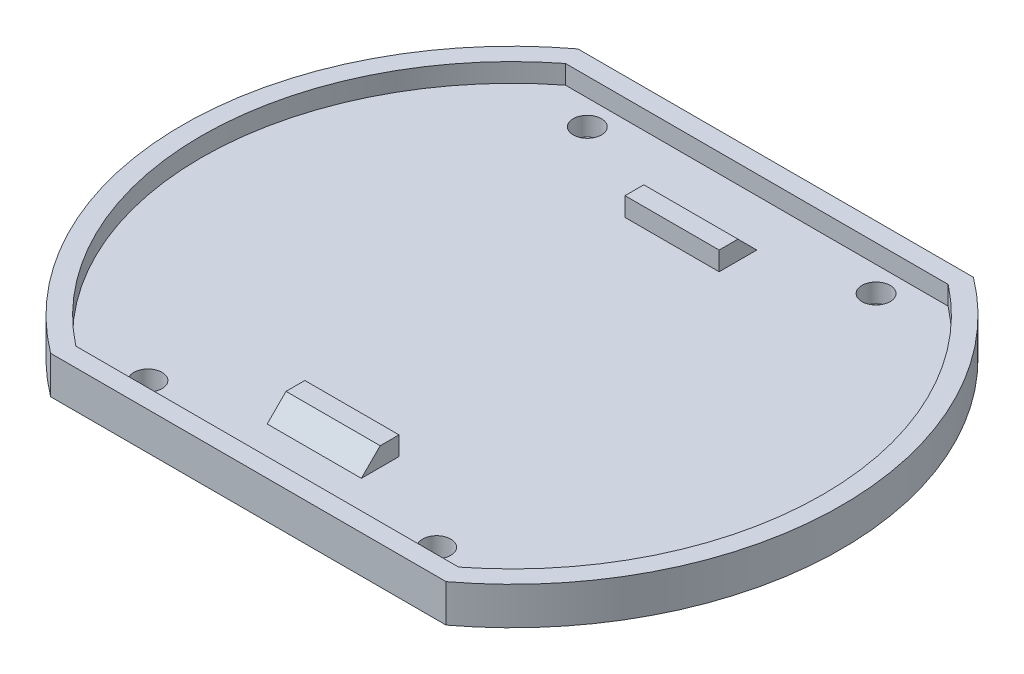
ISO-10303-21;
HEADER;
FILE_DESCRIPTION(('STEP AP214'),'2;1');
FILE_NAME('part.step','',(''),(''),'','','');
FILE_SCHEMA(('AUTOMOTIVE_DESIGN { 1 0 10303 214 1 1 1 1 }'));
ENDSEC;
DATA;
#1=APPLICATION_CONTEXT('core data for automotive mechanical design processes');
#2=APPLICATION_PROTOCOL_DEFINITION('international standard','automotive_design',2000,#1);
#3=PRODUCT_CONTEXT('',#1,'mechanical');
#4=PRODUCT('Part','Part','',(#3));
#5=PRODUCT_RELATED_PRODUCT_CATEGORY('part','',(#4));
#6=PRODUCT_DEFINITION_FORMATION('','',#4);
#7=PRODUCT_DEFINITION_CONTEXT('part definition',#1,'design');
#8=PRODUCT_DEFINITION('design','',#6,#7);
#9=PRODUCT_DEFINITION_SHAPE('','',#8);
#10=(LENGTH_UNIT() NAMED_UNIT(*) SI_UNIT(.MILLI.,.METRE.));
#11=(NAMED_UNIT(*) PLANE_ANGLE_UNIT() SI_UNIT($,.RADIAN.));
#12=(NAMED_UNIT(*) SI_UNIT($,.STERADIAN.) SOLID_ANGLE_UNIT());
#13=UNCERTAINTY_MEASURE_WITH_UNIT(LENGTH_MEASURE(1.E-05),#10,'distance_accuracy_value','');
#14=(GEOMETRIC_REPRESENTATION_CONTEXT(3) GLOBAL_UNCERTAINTY_ASSIGNED_CONTEXT((#13)) GLOBAL_UNIT_ASSIGNED_CONTEXT((#10,
#11,#12)) REPRESENTATION_CONTEXT('',''));
#15=CARTESIAN_POINT('',(0.,0.,0.));
#16=DIRECTION('',(0.,0.,1.));
#17=DIRECTION('',(1.,0.,0.));
#18=AXIS2_PLACEMENT_3D('',#15,#16,#17);
#19=CARTESIAN_POINT('',(0.,3.,0.));
#20=DIRECTION('',(0.,1.,0.));
#21=DIRECTION('',(0.,0.,1.));
#22=AXIS2_PLACEMENT_3D('',#19,#20,#21);
#23=PLANE('',#22);
#24=DIRECTION('',(0.,0.,1.));
#25=VECTOR('',#24,1.);
#26=CARTESIAN_POINT('',(-7.5,3.,-28.5));
#27=LINE('',#26,#25);
#28=CARTESIAN_POINT('',(-7.5,3.,-31.5));
#29=VERTEX_POINT('',#28);
#30=CARTESIAN_POINT('',(-7.5,3.,-25.5));
#31=VERTEX_POINT('',#30);
#32=EDGE_CURVE('E166',#29,#31,#27,.T.);
#33=ORIENTED_EDGE('',*,*,#32,.F.);
#34=DIRECTION('',(1.,0.,0.));
#35=VECTOR('',#34,1.);
#36=CARTESIAN_POINT('',(0.,3.,-31.5));
#37=LINE('',#36,#35);
#38=CARTESIAN_POINT('',(7.5,3.,-31.5));
#39=VERTEX_POINT('',#38);
#40=EDGE_CURVE('E273',#29,#39,#37,.T.);
#41=ORIENTED_EDGE('',*,*,#40,.T.);
#42=DIRECTION('',(0.,0.,-1.));
#43=VECTOR('',#42,1.);
#44=CARTESIAN_POINT('',(7.5,3.,-28.5));
#45=LINE('',#44,#43);
#46=CARTESIAN_POINT('',(7.5,3.,-25.5));
#47=VERTEX_POINT('',#46);
#48=EDGE_CURVE('E178',#47,#39,#45,.T.);
#49=ORIENTED_EDGE('',*,*,#48,.F.);
#50=DIRECTION('',(1.,0.,0.));
#51=VECTOR('',#50,1.);
#52=CARTESIAN_POINT('',(-7.5,3.,-25.5));
#53=LINE('',#52,#51);
#54=EDGE_CURVE('E182',#31,#47,#53,.T.);
#55=ORIENTED_EDGE('',*,*,#54,.F.);
#56=EDGE_LOOP('',(#33,#41,#49,#55));
#57=FACE_BOUND('',#56,.T.);
#58=CARTESIAN_POINT('',(0.,3.,0.));
#59=DIRECTION('',(0.,1.,0.));
#60=DIRECTION('',(0.,0.,1.));
#61=AXIS2_PLACEMENT_3D('',#58,#59,#60);
#62=CIRCLE('',#61,49.5);
#63=CARTESIAN_POINT('',(30.4836021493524,3.,39.));
#64=VERTEX_POINT('',#63);
#65=CARTESIAN_POINT('',(30.4836021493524,3.,-39.));
#66=VERTEX_POINT('',#65);
#67=EDGE_CURVE('E188',#64,#66,#62,.T.);
#68=ORIENTED_EDGE('',*,*,#67,.T.);
#69=DIRECTION('',(-1.,0.,0.));
#70=VECTOR('',#69,1.);
#71=CARTESIAN_POINT('',(30.4836021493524,3.,-39.));
#72=LINE('',#71,#70);
#73=CARTESIAN_POINT('',(-30.4836021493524,3.,-39.));
#74=VERTEX_POINT('',#73);
#75=EDGE_CURVE('E211',#66,#74,#72,.T.);
#76=ORIENTED_EDGE('',*,*,#75,.T.);
#77=CARTESIAN_POINT('',(0.,3.,0.));
#78=DIRECTION('',(0.,1.,0.));
#79=DIRECTION('',(0.,0.,1.));
#80=AXIS2_PLACEMENT_3D('',#77,#78,#79);
#81=CIRCLE('',#80,49.5);
#82=CARTESIAN_POINT('',(-30.4836021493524,3.,39.));
#83=VERTEX_POINT('',#82);
#84=EDGE_CURVE('E213',#74,#83,#81,.T.);
#85=ORIENTED_EDGE('',*,*,#84,.T.);
#86=DIRECTION('',(1.,0.,0.));
#87=VECTOR('',#86,1.);
#88=CARTESIAN_POINT('',(-30.4836021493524,3.,39.));
#89=LINE('',#88,#87);
#90=EDGE_CURVE('E202',#83,#64,#89,.T.);
#91=ORIENTED_EDGE('',*,*,#90,.T.);
#92=EDGE_LOOP('',(#68,#76,#85,#91));
#93=FACE_BOUND('',#92,.T.);
#94=CARTESIAN_POINT('',(-23.,3.,-35.));
#95=DIRECTION('',(0.,1.,0.));
#96=DIRECTION('',(0.,0.,1.));
#97=AXIS2_PLACEMENT_3D('',#94,#95,#96);
#98=CIRCLE('',#97,2.2479);
#99=CARTESIAN_POINT('',(-23.,3.,-32.7521));
#100=VERTEX_POINT('',#99);
#101=EDGE_CURVE('E239',#100,#100,#98,.T.);
#102=ORIENTED_EDGE('',*,*,#101,.F.);
#103=EDGE_LOOP('',(#102));
#104=FACE_BOUND('',#103,.T.);
#105=CARTESIAN_POINT('',(23.,3.,-35.));
#106=DIRECTION('',(0.,1.,0.));
#107=DIRECTION('',(0.,0.,1.));
#108=AXIS2_PLACEMENT_3D('',#105,#106,#107);
#109=CIRCLE('',#108,2.2479);
#110=CARTESIAN_POINT('',(23.,3.,-32.7521));
#111=VERTEX_POINT('',#110);
#112=EDGE_CURVE('E243',#111,#111,#109,.T.);
#113=ORIENTED_EDGE('',*,*,#112,.F.);
#114=EDGE_LOOP('',(#113));
#115=FACE_BOUND('',#114,.T.);
#116=CARTESIAN_POINT('',(23.,3.,35.));
#117=DIRECTION('',(0.,1.,0.));
#118=DIRECTION('',(0.,0.,1.));
#119=AXIS2_PLACEMENT_3D('',#116,#117,#118);
#120=CIRCLE('',#119,2.2479);
#121=CARTESIAN_POINT('',(23.,3.,37.2479));
#122=VERTEX_POINT('',#121);
#123=EDGE_CURVE('E247',#122,#122,#120,.T.);
#124=ORIENTED_EDGE('',*,*,#123,.F.);
#125=EDGE_LOOP('',(#124));
#126=FACE_BOUND('',#125,.T.);
#127=CARTESIAN_POINT('',(-23.,3.,35.));
#128=DIRECTION('',(0.,1.,0.));
#129=DIRECTION('',(0.,0.,1.));
#130=AXIS2_PLACEMENT_3D('',#127,#128,#129);
#131=CIRCLE('',#130,2.2479);
#132=CARTESIAN_POINT('',(-23.,3.,37.2479));
#133=VERTEX_POINT('',#132);
#134=EDGE_CURVE('E251',#133,#133,#131,.T.);
#135=ORIENTED_EDGE('',*,*,#134,.F.);
#136=EDGE_LOOP('',(#135));
#137=FACE_BOUND('',#136,.T.);
#138=DIRECTION('',(0.,0.,-1.));
#139=VECTOR('',#138,1.);
#140=CARTESIAN_POINT('',(7.5,3.,28.5));
#141=LINE('',#140,#139);
#142=CARTESIAN_POINT('',(7.5,3.,31.5));
#143=VERTEX_POINT('',#142);
#144=CARTESIAN_POINT('',(7.5,3.,25.5));
#145=VERTEX_POINT('',#144);
#146=EDGE_CURVE('E47',#143,#145,#141,.T.);
#147=ORIENTED_EDGE('',*,*,#146,.F.);
#148=DIRECTION('',(-1.,0.,0.));
#149=VECTOR('',#148,1.);
#150=CARTESIAN_POINT('',(0.,3.,31.5));
#151=LINE('',#150,#149);
#152=CARTESIAN_POINT('',(-7.5,3.,31.5));
#153=VERTEX_POINT('',#152);
#154=EDGE_CURVE('E284',#143,#153,#151,.T.);
#155=ORIENTED_EDGE('',*,*,#154,.T.);
#156=DIRECTION('',(0.,0.,1.));
#157=VECTOR('',#156,1.);
#158=CARTESIAN_POINT('',(-7.5,3.,28.5));
#159=LINE('',#158,#157);
#160=CARTESIAN_POINT('',(-7.5,3.,25.5));
#161=VERTEX_POINT('',#160);
#162=EDGE_CURVE('E55',#161,#153,#159,.T.);
#163=ORIENTED_EDGE('',*,*,#162,.F.);
#164=DIRECTION('',(-1.,0.,0.));
#165=VECTOR('',#164,1.);
#166=CARTESIAN_POINT('',(-7.5,3.,25.5));
#167=LINE('',#166,#165);
#168=EDGE_CURVE('E150',#145,#161,#167,.T.);
#169=ORIENTED_EDGE('',*,*,#168,.F.);
#170=EDGE_LOOP('',(#147,#155,#163,#169));
#171=FACE_BOUND('',#170,.T.);
#172=ADVANCED_FACE('F32',(#57,#93,#104,#115,#126,#137,#171),#23,.T.);
#173=CARTESIAN_POINT('',(0.,3.,0.));
#174=DIRECTION('',(0.,-1.,0.));
#175=DIRECTION('',(0.,0.,-1.));
#176=AXIS2_PLACEMENT_3D('',#173,#174,#175);
#177=CYLINDRICAL_SURFACE('',#176,52.5);
#178=DIRECTION('',(0.,1.,0.));
#179=VECTOR('',#178,1.);
#180=CARTESIAN_POINT('',(31.5,0.,-42.));
#181=LINE('',#180,#179);
#182=CARTESIAN_POINT('',(31.5,0.,-42.));
#183=VERTEX_POINT('',#182);
#184=CARTESIAN_POINT('',(31.5,6.,-42.));
#185=VERTEX_POINT('',#184);
#186=EDGE_CURVE('E266',#183,#185,#181,.T.);
#187=ORIENTED_EDGE('',*,*,#186,.T.);
#188=CARTESIAN_POINT('',(0.,6.,0.));
#189=DIRECTION('',(0.,1.,0.));
#190=DIRECTION('',(0.,0.,1.));
#191=AXIS2_PLACEMENT_3D('',#188,#189,#190);
#192=CIRCLE('',#191,52.5);
#193=CARTESIAN_POINT('',(31.5,6.,42.));
#194=VERTEX_POINT('',#193);
#195=EDGE_CURVE('E233',#194,#185,#192,.T.);
#196=ORIENTED_EDGE('',*,*,#195,.F.);
#197=DIRECTION('',(0.,1.,0.));
#198=VECTOR('',#197,1.);
#199=CARTESIAN_POINT('',(31.5,0.,42.));
#200=LINE('',#199,#198);
#201=CARTESIAN_POINT('',(31.5,0.,42.));
#202=VERTEX_POINT('',#201);
#203=EDGE_CURVE('E259',#202,#194,#200,.T.);
#204=ORIENTED_EDGE('',*,*,#203,.F.);
#205=CARTESIAN_POINT('',(0.,0.,0.));
#206=DIRECTION('',(0.,1.,0.));
#207=DIRECTION('',(0.,0.,1.));
#208=AXIS2_PLACEMENT_3D('',#205,#206,#207);
#209=CIRCLE('',#208,52.5);
#210=EDGE_CURVE('E268',#202,#183,#209,.T.);
#211=ORIENTED_EDGE('',*,*,#210,.T.);
#212=EDGE_LOOP('',(#187,#196,#204,#211));
#213=FACE_BOUND('',#212,.T.);
#214=ADVANCED_FACE('F319',(#213),#177,.T.);
#215=CARTESIAN_POINT('',(0.,0.,0.));
#216=DIRECTION('',(0.,1.,0.));
#217=DIRECTION('',(0.,0.,1.));
#218=AXIS2_PLACEMENT_3D('',#215,#216,#217);
#219=PLANE('',#218);
#220=CARTESIAN_POINT('',(-23.,0.,-35.));
#221=DIRECTION('',(0.,1.,0.));
#222=DIRECTION('',(0.,0.,1.));
#223=AXIS2_PLACEMENT_3D('',#220,#221,#222);
#224=CIRCLE('',#223,2.2479);
#225=CARTESIAN_POINT('',(-23.,0.,-32.7521));
#226=VERTEX_POINT('',#225);
#227=EDGE_CURVE('E242',#226,#226,#224,.T.);
#228=ORIENTED_EDGE('',*,*,#227,.T.);
#229=EDGE_LOOP('',(#228));
#230=FACE_BOUND('',#229,.T.);
#231=CARTESIAN_POINT('',(23.,0.,-35.));
#232=DIRECTION('',(0.,1.,0.));
#233=DIRECTION('',(0.,0.,1.));
#234=AXIS2_PLACEMENT_3D('',#231,#232,#233);
#235=CIRCLE('',#234,2.2479);
#236=CARTESIAN_POINT('',(23.,0.,-32.7521));
#237=VERTEX_POINT('',#236);
#238=EDGE_CURVE('E246',#237,#237,#235,.T.);
#239=ORIENTED_EDGE('',*,*,#238,.T.);
#240=EDGE_LOOP('',(#239));
#241=FACE_BOUND('',#240,.T.);
#242=CARTESIAN_POINT('',(23.,0.,35.));
#243=DIRECTION('',(0.,1.,0.));
#244=DIRECTION('',(0.,0.,1.));
#245=AXIS2_PLACEMENT_3D('',#242,#243,#244);
#246=CIRCLE('',#245,2.2479);
#247=CARTESIAN_POINT('',(23.,0.,37.2479));
#248=VERTEX_POINT('',#247);
#249=EDGE_CURVE('E250',#248,#248,#246,.T.);
#250=ORIENTED_EDGE('',*,*,#249,.T.);
#251=EDGE_LOOP('',(#250));
#252=FACE_BOUND('',#251,.T.);
#253=CARTESIAN_POINT('',(-23.,0.,35.));
#254=DIRECTION('',(0.,1.,0.));
#255=DIRECTION('',(0.,0.,1.));
#256=AXIS2_PLACEMENT_3D('',#253,#254,#255);
#257=CIRCLE('',#256,2.2479);
#258=CARTESIAN_POINT('',(-23.,0.,37.2479));
#259=VERTEX_POINT('',#258);
#260=EDGE_CURVE('E254',#259,#259,#257,.T.);
#261=ORIENTED_EDGE('',*,*,#260,.T.);
#262=EDGE_LOOP('',(#261));
#263=FACE_BOUND('',#262,.T.);
#264=ORIENTED_EDGE('',*,*,#210,.F.);
#265=DIRECTION('',(-1.,0.,0.));
#266=VECTOR('',#265,1.);
#267=CARTESIAN_POINT('',(-31.5,0.,42.));
#268=LINE('',#267,#266);
#269=CARTESIAN_POINT('',(-31.5,0.,42.));
#270=VERTEX_POINT('',#269);
#271=EDGE_CURVE('E255',#202,#270,#268,.T.);
#272=ORIENTED_EDGE('',*,*,#271,.T.);
#273=CARTESIAN_POINT('',(-31.5,0.,-42.));
#274=VERTEX_POINT('',#273);
#275=EDGE_CURVE('E270',#274,#270,#209,.T.);
#276=ORIENTED_EDGE('',*,*,#275,.F.);
#277=DIRECTION('',(1.,0.,0.));
#278=VECTOR('',#277,1.);
#279=CARTESIAN_POINT('',(-31.5,0.,-42.));
#280=LINE('',#279,#278);
#281=EDGE_CURVE('E261',#274,#183,#280,.T.);
#282=ORIENTED_EDGE('',*,*,#281,.T.);
#283=EDGE_LOOP('',(#264,#272,#276,#282));
#284=FACE_BOUND('',#283,.T.);
#285=ADVANCED_FACE('F324',(#230,#241,#252,#263,#284),#219,.F.);
#286=ORIENTED_EDGE('',*,*,#275,.T.);
#287=DIRECTION('',(0.,1.,0.));
#288=VECTOR('',#287,1.);
#289=CARTESIAN_POINT('',(-31.5,0.,42.));
#290=LINE('',#289,#288);
#291=CARTESIAN_POINT('',(-31.5,6.,42.));
#292=VERTEX_POINT('',#291);
#293=EDGE_CURVE('E258',#270,#292,#290,.T.);
#294=ORIENTED_EDGE('',*,*,#293,.T.);
#295=CARTESIAN_POINT('',(0.,6.,0.));
#296=DIRECTION('',(0.,1.,0.));
#297=DIRECTION('',(0.,0.,1.));
#298=AXIS2_PLACEMENT_3D('',#295,#296,#297);
#299=CIRCLE('',#298,52.5);
#300=CARTESIAN_POINT('',(-31.5,6.,-42.));
#301=VERTEX_POINT('',#300);
#302=EDGE_CURVE('E227',#301,#292,#299,.T.);
#303=ORIENTED_EDGE('',*,*,#302,.F.);
#304=DIRECTION('',(0.,1.,0.));
#305=VECTOR('',#304,1.);
#306=CARTESIAN_POINT('',(-31.5,0.,-42.));
#307=LINE('',#306,#305);
#308=EDGE_CURVE('E265',#274,#301,#307,.T.);
#309=ORIENTED_EDGE('',*,*,#308,.F.);
#310=EDGE_LOOP('',(#286,#294,#303,#309));
#311=FACE_BOUND('',#310,.T.);
#312=ADVANCED_FACE('F327',(#311),#177,.T.);
#313=CARTESIAN_POINT('',(-31.5,0.,-42.));
#314=DIRECTION('',(0.,0.,1.));
#315=DIRECTION('',(1.,0.,0.));
#316=AXIS2_PLACEMENT_3D('',#313,#314,#315);
#317=PLANE('',#316);
#318=ORIENTED_EDGE('',*,*,#308,.T.);
#319=DIRECTION('',(-1.,0.,0.));
#320=VECTOR('',#319,1.);
#321=CARTESIAN_POINT('',(31.5,6.,-42.));
#322=LINE('',#321,#320);
#323=EDGE_CURVE('E236',#185,#301,#322,.T.);
#324=ORIENTED_EDGE('',*,*,#323,.F.);
#325=ORIENTED_EDGE('',*,*,#186,.F.);
#326=ORIENTED_EDGE('',*,*,#281,.F.);
#327=EDGE_LOOP('',(#318,#324,#325,#326));
#328=FACE_BOUND('',#327,.T.);
#329=ADVANCED_FACE('F330',(#328),#317,.F.);
#330=CARTESIAN_POINT('',(-31.5,0.,42.));
#331=DIRECTION('',(0.,0.,-1.));
#332=DIRECTION('',(-1.,0.,0.));
#333=AXIS2_PLACEMENT_3D('',#330,#331,#332);
#334=PLANE('',#333);
#335=ORIENTED_EDGE('',*,*,#203,.T.);
#336=DIRECTION('',(1.,0.,0.));
#337=VECTOR('',#336,1.);
#338=CARTESIAN_POINT('',(-31.5,6.,42.));
#339=LINE('',#338,#337);
#340=EDGE_CURVE('E230',#292,#194,#339,.T.);
#341=ORIENTED_EDGE('',*,*,#340,.F.);
#342=ORIENTED_EDGE('',*,*,#293,.F.);
#343=ORIENTED_EDGE('',*,*,#271,.F.);
#344=EDGE_LOOP('',(#335,#341,#342,#343));
#345=FACE_BOUND('',#344,.T.);
#346=ADVANCED_FACE('F398',(#345),#334,.F.);
#347=CARTESIAN_POINT('',(-23.,3.,35.));
#348=DIRECTION('',(0.,1.,0.));
#349=DIRECTION('',(0.,0.,1.));
#350=AXIS2_PLACEMENT_3D('',#347,#348,#349);
#351=CYLINDRICAL_SURFACE('',#350,2.2479);
#352=ORIENTED_EDGE('',*,*,#134,.T.);
#353=EDGE_LOOP('',(#352));
#354=FACE_BOUND('',#353,.T.);
#355=ORIENTED_EDGE('',*,*,#260,.F.);
#356=EDGE_LOOP('',(#355));
#357=FACE_BOUND('',#356,.T.);
#358=ADVANCED_FACE('F405',(#354,#357),#351,.F.);
#359=CARTESIAN_POINT('',(23.,3.,35.));
#360=DIRECTION('',(0.,1.,0.));
#361=DIRECTION('',(0.,0.,1.));
#362=AXIS2_PLACEMENT_3D('',#359,#360,#361);
#363=CYLINDRICAL_SURFACE('',#362,2.2479);
#364=ORIENTED_EDGE('',*,*,#123,.T.);
#365=EDGE_LOOP('',(#364));
#366=FACE_BOUND('',#365,.T.);
#367=ORIENTED_EDGE('',*,*,#249,.F.);
#368=EDGE_LOOP('',(#367));
#369=FACE_BOUND('',#368,.T.);
#370=ADVANCED_FACE('F413',(#366,#369),#363,.F.);
#371=CARTESIAN_POINT('',(23.,3.,-35.));
#372=DIRECTION('',(0.,1.,0.));
#373=DIRECTION('',(0.,0.,1.));
#374=AXIS2_PLACEMENT_3D('',#371,#372,#373);
#375=CYLINDRICAL_SURFACE('',#374,2.2479);
#376=ORIENTED_EDGE('',*,*,#112,.T.);
#377=EDGE_LOOP('',(#376));
#378=FACE_BOUND('',#377,.T.);
#379=ORIENTED_EDGE('',*,*,#238,.F.);
#380=EDGE_LOOP('',(#379));
#381=FACE_BOUND('',#380,.T.);
#382=ADVANCED_FACE('F423',(#378,#381),#375,.F.);
#383=CARTESIAN_POINT('',(-23.,3.,-35.));
#384=DIRECTION('',(0.,1.,0.));
#385=DIRECTION('',(0.,0.,1.));
#386=AXIS2_PLACEMENT_3D('',#383,#384,#385);
#387=CYLINDRICAL_SURFACE('',#386,2.2479);
#388=ORIENTED_EDGE('',*,*,#101,.T.);
#389=EDGE_LOOP('',(#388));
#390=FACE_BOUND('',#389,.T.);
#391=ORIENTED_EDGE('',*,*,#227,.F.);
#392=EDGE_LOOP('',(#391));
#393=FACE_BOUND('',#392,.T.);
#394=ADVANCED_FACE('F432',(#390,#393),#387,.F.);
#395=CARTESIAN_POINT('',(0.,6.,0.));
#396=DIRECTION('',(0.,1.,0.));
#397=DIRECTION('',(0.,0.,1.));
#398=AXIS2_PLACEMENT_3D('',#395,#396,#397);
#399=PLANE('',#398);
#400=ORIENTED_EDGE('',*,*,#302,.T.);
#401=ORIENTED_EDGE('',*,*,#340,.T.);
#402=ORIENTED_EDGE('',*,*,#195,.T.);
#403=ORIENTED_EDGE('',*,*,#323,.T.);
#404=EDGE_LOOP('',(#400,#401,#402,#403));
#405=FACE_BOUND('',#404,.T.);
#406=DIRECTION('',(-1.,0.,0.));
#407=VECTOR('',#406,1.);
#408=CARTESIAN_POINT('',(30.4836021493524,6.,-39.));
#409=LINE('',#408,#407);
#410=CARTESIAN_POINT('',(30.4836021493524,6.,-39.));
#411=VERTEX_POINT('',#410);
#412=CARTESIAN_POINT('',(-30.4836021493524,6.,-39.));
#413=VERTEX_POINT('',#412);
#414=EDGE_CURVE('E201',#411,#413,#409,.T.);
#415=ORIENTED_EDGE('',*,*,#414,.F.);
#416=CARTESIAN_POINT('',(0.,6.,0.));
#417=DIRECTION('',(0.,1.,0.));
#418=DIRECTION('',(0.,0.,1.));
#419=AXIS2_PLACEMENT_3D('',#416,#417,#418);
#420=CIRCLE('',#419,49.5);
#421=CARTESIAN_POINT('',(30.4836021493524,6.,39.));
#422=VERTEX_POINT('',#421);
#423=EDGE_CURVE('E199',#422,#411,#420,.T.);
#424=ORIENTED_EDGE('',*,*,#423,.F.);
#425=DIRECTION('',(1.,0.,0.));
#426=VECTOR('',#425,1.);
#427=CARTESIAN_POINT('',(-30.4836021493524,6.,39.));
#428=LINE('',#427,#426);
#429=CARTESIAN_POINT('',(-30.4836021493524,6.,39.));
#430=VERTEX_POINT('',#429);
#431=EDGE_CURVE('E207',#430,#422,#428,.T.);
#432=ORIENTED_EDGE('',*,*,#431,.F.);
#433=CARTESIAN_POINT('',(0.,6.,0.));
#434=DIRECTION('',(0.,1.,0.));
#435=DIRECTION('',(0.,0.,1.));
#436=AXIS2_PLACEMENT_3D('',#433,#434,#435);
#437=CIRCLE('',#436,49.5);
#438=EDGE_CURVE('E204',#413,#430,#437,.T.);
#439=ORIENTED_EDGE('',*,*,#438,.F.);
#440=EDGE_LOOP('',(#415,#424,#432,#439));
#441=FACE_BOUND('',#440,.T.);
#442=ADVANCED_FACE('F441',(#405,#441),#399,.T.);
#443=CARTESIAN_POINT('',(0.,6.,0.));
#444=DIRECTION('',(0.,-1.,0.));
#445=DIRECTION('',(0.,0.,-1.));
#446=AXIS2_PLACEMENT_3D('',#443,#444,#445);
#447=CYLINDRICAL_SURFACE('',#446,49.5);
#448=ORIENTED_EDGE('',*,*,#67,.F.);
#449=DIRECTION('',(0.,-1.,0.));
#450=VECTOR('',#449,1.);
#451=CARTESIAN_POINT('',(30.4836021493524,6.,39.));
#452=LINE('',#451,#450);
#453=EDGE_CURVE('E209',#422,#64,#452,.T.);
#454=ORIENTED_EDGE('',*,*,#453,.F.);
#455=ORIENTED_EDGE('',*,*,#423,.T.);
#456=DIRECTION('',(0.,-1.,0.));
#457=VECTOR('',#456,1.);
#458=CARTESIAN_POINT('',(30.4836021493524,6.,-39.));
#459=LINE('',#458,#457);
#460=EDGE_CURVE('E224',#411,#66,#459,.T.);
#461=ORIENTED_EDGE('',*,*,#460,.T.);
#462=EDGE_LOOP('',(#448,#454,#455,#461));
#463=FACE_BOUND('',#462,.T.);
#464=ADVANCED_FACE('F450',(#463),#447,.F.);
#465=CARTESIAN_POINT('',(30.4836021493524,6.,-39.));
#466=DIRECTION('',(0.,0.,1.));
#467=DIRECTION('',(1.,0.,0.));
#468=AXIS2_PLACEMENT_3D('',#465,#466,#467);
#469=PLANE('',#468);
#470=ORIENTED_EDGE('',*,*,#75,.F.);
#471=ORIENTED_EDGE('',*,*,#460,.F.);
#472=ORIENTED_EDGE('',*,*,#414,.T.);
#473=DIRECTION('',(0.,-1.,0.));
#474=VECTOR('',#473,1.);
#475=CARTESIAN_POINT('',(-30.4836021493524,6.,-39.));
#476=LINE('',#475,#474);
#477=EDGE_CURVE('E221',#413,#74,#476,.T.);
#478=ORIENTED_EDGE('',*,*,#477,.T.);
#479=EDGE_LOOP('',(#470,#471,#472,#478));
#480=FACE_BOUND('',#479,.T.);
#481=ADVANCED_FACE('F458',(#480),#469,.T.);
#482=CARTESIAN_POINT('',(0.,6.,0.));
#483=DIRECTION('',(0.,-1.,0.));
#484=DIRECTION('',(0.,0.,-1.));
#485=AXIS2_PLACEMENT_3D('',#482,#483,#484);
#486=CYLINDRICAL_SURFACE('',#485,49.5);
#487=ORIENTED_EDGE('',*,*,#84,.F.);
#488=ORIENTED_EDGE('',*,*,#477,.F.);
#489=ORIENTED_EDGE('',*,*,#438,.T.);
#490=DIRECTION('',(0.,-1.,0.));
#491=VECTOR('',#490,1.);
#492=CARTESIAN_POINT('',(-30.4836021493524,6.,39.));
#493=LINE('',#492,#491);
#494=EDGE_CURVE('E218',#430,#83,#493,.T.);
#495=ORIENTED_EDGE('',*,*,#494,.T.);
#496=EDGE_LOOP('',(#487,#488,#489,#495));
#497=FACE_BOUND('',#496,.T.);
#498=ADVANCED_FACE('F466',(#497),#486,.F.);
#499=CARTESIAN_POINT('',(-30.4836021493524,6.,39.));
#500=DIRECTION('',(0.,0.,-1.));
#501=DIRECTION('',(-1.,0.,0.));
#502=AXIS2_PLACEMENT_3D('',#499,#500,#501);
#503=PLANE('',#502);
#504=ORIENTED_EDGE('',*,*,#90,.F.);
#505=ORIENTED_EDGE('',*,*,#494,.F.);
#506=ORIENTED_EDGE('',*,*,#431,.T.);
#507=ORIENTED_EDGE('',*,*,#453,.T.);
#508=EDGE_LOOP('',(#504,#505,#506,#507));
#509=FACE_BOUND('',#508,.T.);
#510=ADVANCED_FACE('F474',(#509),#503,.T.);
#511=CARTESIAN_POINT('',(-7.5,21.2970585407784,-28.5));
#512=DIRECTION('',(1.,0.,0.));
#513=DIRECTION('',(0.,0.,-1.));
#514=AXIS2_PLACEMENT_3D('',#511,#512,#513);
#515=PLANE('',#514);
#516=DIRECTION('',(0.,0.,1.));
#517=VECTOR('',#516,1.);
#518=CARTESIAN_POINT('',(-7.5,6.,-28.5));
#519=LINE('',#518,#517);
#520=CARTESIAN_POINT('',(-7.5,6.,-28.5));
#521=VERTEX_POINT('',#520);
#522=CARTESIAN_POINT('',(-7.5,6.,-25.5));
#523=VERTEX_POINT('',#522);
#524=EDGE_CURVE('E192',#521,#523,#519,.T.);
#525=ORIENTED_EDGE('',*,*,#524,.F.);
#526=DIRECTION('',(0.,-0.707106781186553,-0.707106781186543));
#527=VECTOR('',#526,1.);
#528=CARTESIAN_POINT('',(-7.5,13.6485292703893,-20.8514707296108));
#529=LINE('',#528,#527);
#530=EDGE_CURVE('E40',#521,#29,#529,.T.);
#531=ORIENTED_EDGE('',*,*,#530,.T.);
#532=ORIENTED_EDGE('',*,*,#32,.T.);
#533=DIRECTION('',(0.,-1.,0.));
#534=VECTOR('',#533,1.);
#535=CARTESIAN_POINT('',(-7.5,21.2970585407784,-25.5));
#536=LINE('',#535,#534);
#537=EDGE_CURVE('E169',#523,#31,#536,.T.);
#538=ORIENTED_EDGE('',*,*,#537,.F.);
#539=EDGE_LOOP('',(#525,#531,#532,#538));
#540=FACE_BOUND('',#539,.T.);
#541=ADVANCED_FACE('F292',(#540),#515,.F.);
#542=CARTESIAN_POINT('',(-7.5,21.2970585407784,-25.5));
#543=DIRECTION('',(0.,0.,-1.));
#544=DIRECTION('',(-1.,0.,0.));
#545=AXIS2_PLACEMENT_3D('',#542,#543,#544);
#546=PLANE('',#545);
#547=DIRECTION('',(1.,0.,0.));
#548=VECTOR('',#547,1.);
#549=CARTESIAN_POINT('',(-7.5,6.,-25.5));
#550=LINE('',#549,#548);
#551=CARTESIAN_POINT('',(7.5,6.,-25.5));
#552=VERTEX_POINT('',#551);
#553=EDGE_CURVE('E189',#523,#552,#550,.T.);
#554=ORIENTED_EDGE('',*,*,#553,.F.);
#555=ORIENTED_EDGE('',*,*,#537,.T.);
#556=ORIENTED_EDGE('',*,*,#54,.T.);
#557=DIRECTION('',(0.,-1.,0.));
#558=VECTOR('',#557,1.);
#559=CARTESIAN_POINT('',(7.5,21.2970585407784,-25.5));
#560=LINE('',#559,#558);
#561=EDGE_CURVE('E181',#552,#47,#560,.T.);
#562=ORIENTED_EDGE('',*,*,#561,.F.);
#563=EDGE_LOOP('',(#554,#555,#556,#562));
#564=FACE_BOUND('',#563,.T.);
#565=ADVANCED_FACE('F303',(#564),#546,.F.);
#566=CARTESIAN_POINT('',(7.5,21.2970585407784,-28.5));
#567=DIRECTION('',(-1.,0.,0.));
#568=DIRECTION('',(0.,0.,1.));
#569=AXIS2_PLACEMENT_3D('',#566,#567,#568);
#570=PLANE('',#569);
#571=DIRECTION('',(0.,0.,-1.));
#572=VECTOR('',#571,1.);
#573=CARTESIAN_POINT('',(7.5,6.,-28.5));
#574=LINE('',#573,#572);
#575=CARTESIAN_POINT('',(7.5,6.,-28.5));
#576=VERTEX_POINT('',#575);
#577=EDGE_CURVE('E185',#552,#576,#574,.T.);
#578=ORIENTED_EDGE('',*,*,#577,.F.);
#579=ORIENTED_EDGE('',*,*,#561,.T.);
#580=ORIENTED_EDGE('',*,*,#48,.T.);
#581=DIRECTION('',(0.,0.707106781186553,0.707106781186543));
#582=VECTOR('',#581,1.);
#583=CARTESIAN_POINT('',(7.5,13.6485292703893,-20.8514707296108));
#584=LINE('',#583,#582);
#585=EDGE_CURVE('E11',#39,#576,#584,.T.);
#586=ORIENTED_EDGE('',*,*,#585,.T.);
#587=EDGE_LOOP('',(#578,#579,#580,#586));
#588=FACE_BOUND('',#587,.T.);
#589=ADVANCED_FACE('F307',(#588),#570,.F.);
#590=CARTESIAN_POINT('',(0.,6.,0.));
#591=DIRECTION('',(0.,1.,0.));
#592=DIRECTION('',(0.,0.,1.));
#593=AXIS2_PLACEMENT_3D('',#590,#591,#592);
#594=PLANE('',#593);
#595=DIRECTION('',(-1.,0.,0.));
#596=VECTOR('',#595,1.);
#597=CARTESIAN_POINT('',(-7.5,6.,-28.5));
#598=LINE('',#597,#596);
#599=EDGE_CURVE('E180',#576,#521,#598,.T.);
#600=ORIENTED_EDGE('',*,*,#599,.T.);
#601=ORIENTED_EDGE('',*,*,#524,.T.);
#602=ORIENTED_EDGE('',*,*,#553,.T.);
#603=ORIENTED_EDGE('',*,*,#577,.T.);
#604=EDGE_LOOP('',(#600,#601,#602,#603));
#605=FACE_BOUND('',#604,.T.);
#606=ADVANCED_FACE('F305',(#605),#594,.T.);
#607=CARTESIAN_POINT('',(7.5,21.2970585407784,28.5));
#608=DIRECTION('',(-1.,0.,0.));
#609=DIRECTION('',(0.,0.,1.));
#610=AXIS2_PLACEMENT_3D('',#607,#608,#609);
#611=PLANE('',#610);
#612=DIRECTION('',(0.,0.,-1.));
#613=VECTOR('',#612,1.);
#614=CARTESIAN_POINT('',(7.5,6.,28.5));
#615=LINE('',#614,#613);
#616=CARTESIAN_POINT('',(7.5,6.,28.5));
#617=VERTEX_POINT('',#616);
#618=CARTESIAN_POINT('',(7.5,6.,25.5));
#619=VERTEX_POINT('',#618);
#620=EDGE_CURVE('E165',#617,#619,#615,.T.);
#621=ORIENTED_EDGE('',*,*,#620,.F.);
#622=DIRECTION('',(0.,-0.707106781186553,0.707106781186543));
#623=VECTOR('',#622,1.);
#624=CARTESIAN_POINT('',(7.5,13.6485292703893,20.8514707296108));
#625=LINE('',#624,#623);
#626=EDGE_CURVE('E286',#617,#143,#625,.T.);
#627=ORIENTED_EDGE('',*,*,#626,.T.);
#628=ORIENTED_EDGE('',*,*,#146,.T.);
#629=DIRECTION('',(0.,-1.,0.));
#630=VECTOR('',#629,1.);
#631=CARTESIAN_POINT('',(7.5,21.2970585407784,25.5));
#632=LINE('',#631,#630);
#633=EDGE_CURVE('E176',#619,#145,#632,.T.);
#634=ORIENTED_EDGE('',*,*,#633,.F.);
#635=EDGE_LOOP('',(#621,#627,#628,#634));
#636=FACE_BOUND('',#635,.T.);
#637=ADVANCED_FACE('F314',(#636),#611,.F.);
#638=CARTESIAN_POINT('',(-7.5,21.2970585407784,25.5));
#639=DIRECTION('',(0.,0.,1.));
#640=DIRECTION('',(1.,0.,0.));
#641=AXIS2_PLACEMENT_3D('',#638,#639,#640);
#642=PLANE('',#641);
#643=DIRECTION('',(-1.,0.,0.));
#644=VECTOR('',#643,1.);
#645=CARTESIAN_POINT('',(-7.5,6.,25.5));
#646=LINE('',#645,#644);
#647=CARTESIAN_POINT('',(-7.5,6.,25.5));
#648=VERTEX_POINT('',#647);
#649=EDGE_CURVE('E148',#619,#648,#646,.T.);
#650=ORIENTED_EDGE('',*,*,#649,.F.);
#651=ORIENTED_EDGE('',*,*,#633,.T.);
#652=ORIENTED_EDGE('',*,*,#168,.T.);
#653=DIRECTION('',(0.,-1.,0.));
#654=VECTOR('',#653,1.);
#655=CARTESIAN_POINT('',(-7.5,21.2970585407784,25.5));
#656=LINE('',#655,#654);
#657=EDGE_CURVE('E144',#648,#161,#656,.T.);
#658=ORIENTED_EDGE('',*,*,#657,.F.);
#659=EDGE_LOOP('',(#650,#651,#652,#658));
#660=FACE_BOUND('',#659,.T.);
#661=ADVANCED_FACE('F146',(#660),#642,.F.);
#662=CARTESIAN_POINT('',(-7.5,21.2970585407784,28.5));
#663=DIRECTION('',(1.,0.,0.));
#664=DIRECTION('',(0.,0.,-1.));
#665=AXIS2_PLACEMENT_3D('',#662,#663,#664);
#666=PLANE('',#665);
#667=DIRECTION('',(0.,0.,1.));
#668=VECTOR('',#667,1.);
#669=CARTESIAN_POINT('',(-7.5,6.,28.5));
#670=LINE('',#669,#668);
#671=CARTESIAN_POINT('',(-7.5,6.,28.5));
#672=VERTEX_POINT('',#671);
#673=EDGE_CURVE('E153',#648,#672,#670,.T.);
#674=ORIENTED_EDGE('',*,*,#673,.F.);
#675=ORIENTED_EDGE('',*,*,#657,.T.);
#676=ORIENTED_EDGE('',*,*,#162,.T.);
#677=DIRECTION('',(0.,0.707106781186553,-0.707106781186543));
#678=VECTOR('',#677,1.);
#679=CARTESIAN_POINT('',(-7.5,13.6485292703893,20.8514707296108));
#680=LINE('',#679,#678);
#681=EDGE_CURVE('E156',#153,#672,#680,.T.);
#682=ORIENTED_EDGE('',*,*,#681,.T.);
#683=EDGE_LOOP('',(#674,#675,#676,#682));
#684=FACE_BOUND('',#683,.T.);
#685=ADVANCED_FACE('F154',(#684),#666,.F.);
#686=CARTESIAN_POINT('',(0.,6.,0.));
#687=DIRECTION('',(0.,1.,0.));
#688=DIRECTION('',(0.,0.,1.));
#689=AXIS2_PLACEMENT_3D('',#686,#687,#688);
#690=PLANE('',#689);
#691=ORIENTED_EDGE('',*,*,#673,.T.);
#692=DIRECTION('',(1.,0.,0.));
#693=VECTOR('',#692,1.);
#694=CARTESIAN_POINT('',(-7.5,6.,28.5));
#695=LINE('',#694,#693);
#696=EDGE_CURVE('E160',#672,#617,#695,.T.);
#697=ORIENTED_EDGE('',*,*,#696,.T.);
#698=ORIENTED_EDGE('',*,*,#620,.T.);
#699=ORIENTED_EDGE('',*,*,#649,.T.);
#700=EDGE_LOOP('',(#691,#697,#698,#699));
#701=FACE_BOUND('',#700,.T.);
#702=ADVANCED_FACE('F163',(#701),#690,.T.);
#703=CARTESIAN_POINT('',(-7.5,6.00000000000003,28.5));
#704=DIRECTION('',(0.,-0.707106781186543,-0.707106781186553));
#705=DIRECTION('',(1.,0.,0.));
#706=AXIS2_PLACEMENT_3D('',#703,#704,#705);
#707=PLANE('',#706);
#708=ORIENTED_EDGE('',*,*,#681,.F.);
#709=ORIENTED_EDGE('',*,*,#154,.F.);
#710=ORIENTED_EDGE('',*,*,#626,.F.);
#711=ORIENTED_EDGE('',*,*,#696,.F.);
#712=EDGE_LOOP('',(#708,#709,#710,#711));
#713=FACE_BOUND('',#712,.T.);
#714=ADVANCED_FACE('F336',(#713),#707,.F.);
#715=CARTESIAN_POINT('',(-7.5,6.00000000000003,-28.5));
#716=DIRECTION('',(0.,-0.707106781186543,0.707106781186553));
#717=DIRECTION('',(-1.,0.,0.));
#718=AXIS2_PLACEMENT_3D('',#715,#716,#717);
#719=PLANE('',#718);
#720=ORIENTED_EDGE('',*,*,#585,.F.);
#721=ORIENTED_EDGE('',*,*,#40,.F.);
#722=ORIENTED_EDGE('',*,*,#530,.F.);
#723=ORIENTED_EDGE('',*,*,#599,.F.);
#724=EDGE_LOOP('',(#720,#721,#722,#723));
#725=FACE_BOUND('',#724,.T.);
#726=ADVANCED_FACE('F34',(#725),#719,.F.);
#727=CLOSED_SHELL('',(#172,#214,#285,#312,#329,#346,#358,#370,#382,#394,#442,#464,#481,#498,
#510,#541,#565,#589,#606,#637,#661,#685,#702,#714,#726));
#728=MANIFOLD_SOLID_BREP('B2',#727);
#729=ADVANCED_BREP_SHAPE_REPRESENTATION('',(#18,#728),#14);
#730=SHAPE_DEFINITION_REPRESENTATION(#9,#729);
ENDSEC;
END-ISO-10303-21;
